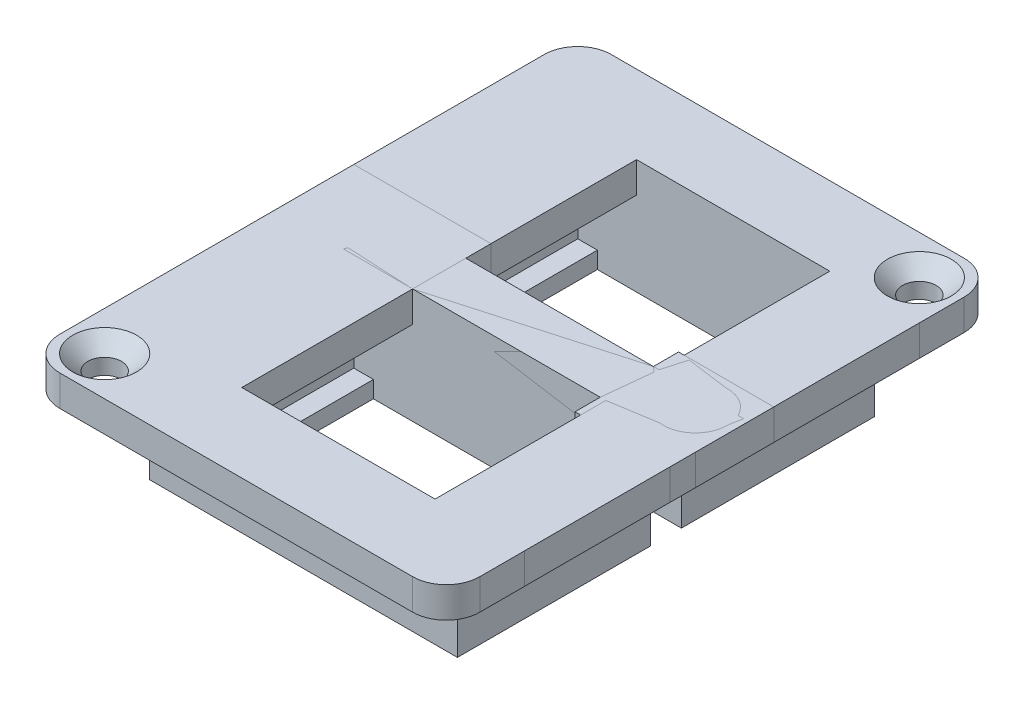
from build123d import *

# Parameters (mm, degrees)
BOSS_EXTRUDE1_DEPTH   = 15.25
BOSS_EXTRUDE1_2_DEPTH = 15.25
SKETCH2_W             = 37.506767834
SKETCH2_H             = 2.746604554
BOSS_EXTRUDE2_DEPTH   = 7
SKETCH3_W             = 37.506767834
SKETCH3_H             = 2.746604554
BOSS_EXTRUDE3_DEPTH   = 7
SKETCH9_R             = 1.5
CUT_EXTRUDE1_DEPTH    = 12
SKETCH11_W            = 27.5
SKETCH11_H            = 1
BOSS_EXTRUDE5_DEPTH   = 7.503395
LPATTERN3_COUNT       = 2
LPATTERN3_PITCH       = 20
FILLET1_R             = 3
FILLET2_R             = 3
SKETCH13_W            = 16.753383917
SKETCH13_H            = 15.25
CUT_EXTRUDE4_DEPTH    = 10


with BuildPart() as part:
    # Sketch1 → Boss-Extrude1 (new body)
    with BuildSketch(Plane.XY):
        Polygon((10.25, -8), (10.25, -9.5), (13.75, -9.5), (13.75, -1.996604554), (18.75, -1.996604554), (18.75, 0.75), (10.753383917, 0.75), (10.753383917, -1.996604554), (11.75, -1.996604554), (11.75, -8), align=None)
    extrude(amount=BOSS_EXTRUDE1_DEPTH)



with BuildPart() as body_2:
    # Sketch1 → Boss-Extrude1 2 (new body)
    with BuildSketch(Plane.XY):
        Polygon((-11.75, -8), (-10, -8), (-10, -9.5), (-13.75, -9.5), (-13.75, -1.996604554), (-18.75, -1.996604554), (-18.75, 0.75), (-6.503383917, 0.75), (-6.503383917, -1.996604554), (-11.75, -1.996604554), align=None)
    extrude(amount=BOSS_EXTRUDE1_2_DEPTH)


with BuildPart() as part_1:
    add(part.part)

    add(body_2.part)  # Boss-Extrude2 merges body 2
    # Sketch2 → Boss-Extrude2 (add)
    with BuildSketch(Plane.XY.offset(15.25)):
        with Locations((0, -0.623302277)):
            Rectangle(SKETCH2_W, SKETCH2_H)
    extrude(amount=BOSS_EXTRUDE2_DEPTH)

    # Sketch3 → Boss-Extrude3 (add)
    with BuildSketch(Plane(origin=(0, 0, 0), x_dir=(-1, 0, 0), z_dir=(0, 0, -1))):
        with Locations((0, -0.623302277)):
            Rectangle(SKETCH3_W, SKETCH3_H)
    extrude(amount=BOSS_EXTRUDE3_DEPTH)

    # Sketch9 → Cut-Extrude1 (cut)
    with BuildSketch(Plane.XZ.offset(1.996604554)):
        with Locations(Location((-15.25, 18.75, 0), (0, 0, 270))):
            Circle(SKETCH9_R)
        with Locations(Location((15.25, -3.5, 0), (0, 0, 270))):
            Circle(SKETCH9_R)
    extrude(amount=-CUT_EXTRUDE1_DEPTH, mode=Mode.SUBTRACT)

    # Cut-Extrude2 cone 1 section (on through the dimple's axis) → Cut-Extrude2 (revolve, cut)
    with BuildSketch(Plane(origin=(-15.25, 0.75, 18.75), x_dir=(0, 0, 1), z_dir=(1, 0, 0))):
        Polygon((0, 0), (2.85, 0), (0, 2.85), align=None)
    revolve(axis=Axis((-15.25, 0.75, 18.75), (0, -1, 0)), mode=Mode.SUBTRACT)

    # Cut-Extrude2 cone 2 section (on through the dimple's axis) → Cut-Extrude2 cone 2 (revolve, cut)
    with BuildSketch(Plane(origin=(15.25, 0.75, -3.5), x_dir=(0, 0, 1), z_dir=(1, 0, 0))):
        Polygon((0, 0), (2.85, 0), (0, 2.85), align=None)
    revolve(axis=Axis((15.25, 0.75, -3.5), (0, -1, 0)), mode=Mode.SUBTRACT)

    # Sketch11 → Boss-Extrude5 (add)
    with BuildSketch(Plane.XZ.offset(1.996604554)):
        with Locations((0, 15.75)):
            Rectangle(SKETCH11_W, SKETCH11_H)
        with Locations((0, -0.5)):
            Rectangle(SKETCH11_W, SKETCH11_H)
    extrude(amount=BOSS_EXTRUDE5_DEPTH)


with BuildPart() as lpattern3_1:
    # LPattern3: pattern copy
    add(part_1.part.moved(Location(Vector(0, 0, -1) * (1 * LPATTERN3_PITCH))))

    # Fillet2
    fillet2_edges = [lpattern3_1.edges().sort_by_distance(p)[0] for p in [
        (18.753383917, -0.623302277, -27),
        (-18.753383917, -0.623302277, -27),
    ]]
    fillet(fillet2_edges, radius=FILLET2_R)


with BuildPart() as part_2:
    add(part_1.part)

    # Fillet1
    fillet1_edges = [part_2.edges().sort_by_distance(p)[0] for p in [
        (-18.753383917, -0.623302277, 22.25),
        (18.753383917, -0.623302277, 22.25),
    ]]
    fillet(fillet1_edges, radius=FILLET1_R)


with BuildPart() as cut_extrude4_tool:
    # Sketch13 → Cut-Extrude4 (new body)
    with BuildSketch(Plane.XZ.offset(1.996604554)):
        with Locations((1.873308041, 7.625)):
            Rectangle(SKETCH13_W, SKETCH13_H)
        with Locations((1.873308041, -12.375)):
            Rectangle(SKETCH13_W, SKETCH13_H)
    extrude(amount=-CUT_EXTRUDE4_DEPTH)


with BuildPart() as part_3:
    add(part_2.part)

    # Cut-Extrude4: cut by cut_extrude4_tool
    add(cut_extrude4_tool.part, mode=Mode.SUBTRACT)


with BuildPart() as lpattern3_1_1:
    add(lpattern3_1.part)

    # Cut-Extrude4: cut by cut_extrude4_tool
    add(cut_extrude4_tool.part, mode=Mode.SUBTRACT)


solid = Compound([part_3.part, lpattern3_1_1.part])
